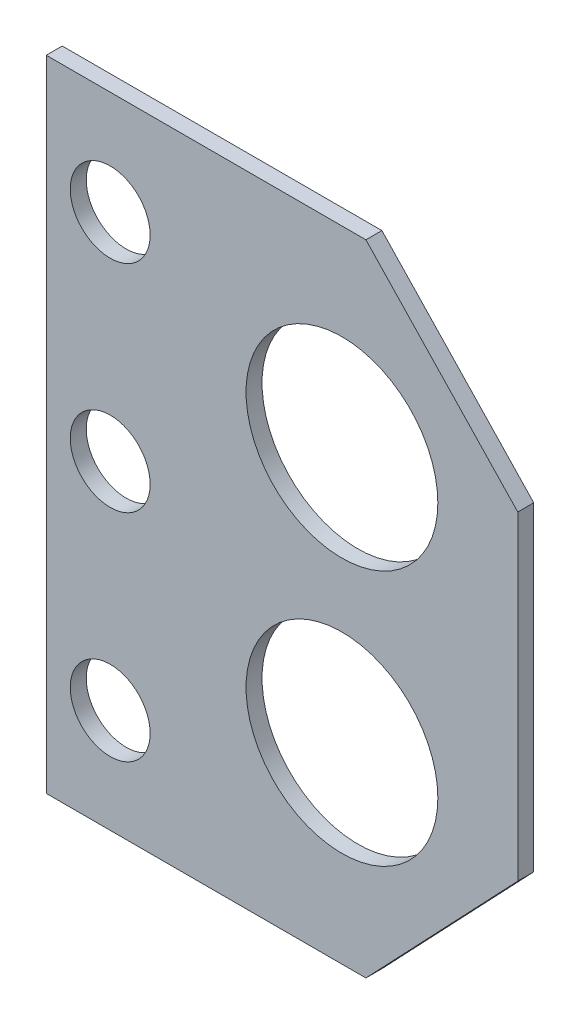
ISO-10303-21;
HEADER;
FILE_DESCRIPTION(('STEP AP214'),'2;1');
FILE_NAME('part.step','',(''),(''),'','','');
FILE_SCHEMA(('AUTOMOTIVE_DESIGN { 1 0 10303 214 1 1 1 1 }'));
ENDSEC;
DATA;
#1=APPLICATION_CONTEXT('core data for automotive mechanical design processes');
#2=APPLICATION_PROTOCOL_DEFINITION('international standard','automotive_design',2000,#1);
#3=PRODUCT_CONTEXT('',#1,'mechanical');
#4=PRODUCT('Part','Part','',(#3));
#5=PRODUCT_RELATED_PRODUCT_CATEGORY('part','',(#4));
#6=PRODUCT_DEFINITION_FORMATION('','',#4);
#7=PRODUCT_DEFINITION_CONTEXT('part definition',#1,'design');
#8=PRODUCT_DEFINITION('design','',#6,#7);
#9=PRODUCT_DEFINITION_SHAPE('','',#8);
#10=(LENGTH_UNIT() NAMED_UNIT(*) SI_UNIT(.MILLI.,.METRE.));
#11=(NAMED_UNIT(*) PLANE_ANGLE_UNIT() SI_UNIT($,.RADIAN.));
#12=(NAMED_UNIT(*) SI_UNIT($,.STERADIAN.) SOLID_ANGLE_UNIT());
#13=UNCERTAINTY_MEASURE_WITH_UNIT(LENGTH_MEASURE(1.E-05),#10,'distance_accuracy_value','');
#14=(GEOMETRIC_REPRESENTATION_CONTEXT(3) GLOBAL_UNCERTAINTY_ASSIGNED_CONTEXT((#13)) GLOBAL_UNIT_ASSIGNED_CONTEXT((#10,
#11,#12)) REPRESENTATION_CONTEXT('',''));
#15=CARTESIAN_POINT('',(0.,0.,0.));
#16=DIRECTION('',(0.,0.,1.));
#17=DIRECTION('',(1.,0.,0.));
#18=AXIS2_PLACEMENT_3D('',#15,#16,#17);
#19=CARTESIAN_POINT('',(200.,0.,10.));
#20=DIRECTION('',(0.,1.,0.));
#21=DIRECTION('',(0.,0.,1.));
#22=AXIS2_PLACEMENT_3D('',#19,#20,#21);
#23=PLANE('',#22);
#24=DIRECTION('',(1.,0.,0.));
#25=VECTOR('',#24,1.);
#26=CARTESIAN_POINT('',(200.,0.,0.));
#27=LINE('',#26,#25);
#28=CARTESIAN_POINT('',(0.,0.,0.));
#29=VERTEX_POINT('',#28);
#30=CARTESIAN_POINT('',(200.,0.,0.));
#31=VERTEX_POINT('',#30);
#32=EDGE_CURVE('E117',#29,#31,#27,.T.);
#33=ORIENTED_EDGE('',*,*,#32,.T.);
#34=DIRECTION('',(0.,0.,-1.));
#35=VECTOR('',#34,1.);
#36=CARTESIAN_POINT('',(200.,0.,10.));
#37=LINE('',#36,#35);
#38=CARTESIAN_POINT('',(200.,0.,10.));
#39=VERTEX_POINT('',#38);
#40=EDGE_CURVE('E11',#39,#31,#37,.T.);
#41=ORIENTED_EDGE('',*,*,#40,.F.);
#42=DIRECTION('',(1.,0.,0.));
#43=VECTOR('',#42,1.);
#44=CARTESIAN_POINT('',(200.,0.,10.));
#45=LINE('',#44,#43);
#46=CARTESIAN_POINT('',(0.,0.,10.));
#47=VERTEX_POINT('',#46);
#48=EDGE_CURVE('E128',#47,#39,#45,.T.);
#49=ORIENTED_EDGE('',*,*,#48,.F.);
#50=DIRECTION('',(0.,0.,-1.));
#51=VECTOR('',#50,1.);
#52=CARTESIAN_POINT('',(0.,0.,10.));
#53=LINE('',#52,#51);
#54=EDGE_CURVE('E113',#47,#29,#53,.T.);
#55=ORIENTED_EDGE('',*,*,#54,.T.);
#56=EDGE_LOOP('',(#33,#41,#49,#55));
#57=FACE_BOUND('',#56,.T.);
#58=ADVANCED_FACE('F33',(#57),#23,.F.);
#59=CARTESIAN_POINT('',(295.,100.,10.));
#60=DIRECTION('',(-0.724999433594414,0.688749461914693,0.));
#61=DIRECTION('',(-0.688749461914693,-0.724999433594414,0.));
#62=AXIS2_PLACEMENT_3D('',#59,#60,#61);
#63=PLANE('',#62);
#64=DIRECTION('',(0.688749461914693,0.724999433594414,0.));
#65=VECTOR('',#64,1.);
#66=CARTESIAN_POINT('',(295.,100.,0.));
#67=LINE('',#66,#65);
#68=CARTESIAN_POINT('',(295.,100.,0.));
#69=VERTEX_POINT('',#68);
#70=EDGE_CURVE('E120',#31,#69,#67,.T.);
#71=ORIENTED_EDGE('',*,*,#70,.T.);
#72=DIRECTION('',(0.,0.,-1.));
#73=VECTOR('',#72,1.);
#74=CARTESIAN_POINT('',(295.,100.,10.));
#75=LINE('',#74,#73);
#76=CARTESIAN_POINT('',(295.,100.,10.));
#77=VERTEX_POINT('',#76);
#78=EDGE_CURVE('E41',#77,#69,#75,.T.);
#79=ORIENTED_EDGE('',*,*,#78,.F.);
#80=DIRECTION('',(0.688749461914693,0.724999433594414,0.));
#81=VECTOR('',#80,1.);
#82=CARTESIAN_POINT('',(295.,100.,10.));
#83=LINE('',#82,#81);
#84=EDGE_CURVE('E86',#39,#77,#83,.T.);
#85=ORIENTED_EDGE('',*,*,#84,.F.);
#86=ORIENTED_EDGE('',*,*,#40,.T.);
#87=EDGE_LOOP('',(#71,#79,#85,#86));
#88=FACE_BOUND('',#87,.T.);
#89=ADVANCED_FACE('F153',(#88),#63,.F.);
#90=CARTESIAN_POINT('',(295.,300.,10.));
#91=DIRECTION('',(-1.,0.,0.));
#92=DIRECTION('',(0.,0.,1.));
#93=AXIS2_PLACEMENT_3D('',#90,#91,#92);
#94=PLANE('',#93);
#95=DIRECTION('',(0.,1.,0.));
#96=VECTOR('',#95,1.);
#97=CARTESIAN_POINT('',(295.,300.,0.));
#98=LINE('',#97,#96);
#99=CARTESIAN_POINT('',(295.,300.,0.));
#100=VERTEX_POINT('',#99);
#101=EDGE_CURVE('E123',#69,#100,#98,.T.);
#102=ORIENTED_EDGE('',*,*,#101,.T.);
#103=DIRECTION('',(0.,0.,-1.));
#104=VECTOR('',#103,1.);
#105=CARTESIAN_POINT('',(295.,300.,10.));
#106=LINE('',#105,#104);
#107=CARTESIAN_POINT('',(295.,300.,10.));
#108=VERTEX_POINT('',#107);
#109=EDGE_CURVE('E108',#108,#100,#106,.T.);
#110=ORIENTED_EDGE('',*,*,#109,.F.);
#111=DIRECTION('',(0.,1.,0.));
#112=VECTOR('',#111,1.);
#113=CARTESIAN_POINT('',(295.,300.,10.));
#114=LINE('',#113,#112);
#115=EDGE_CURVE('E99',#77,#108,#114,.T.);
#116=ORIENTED_EDGE('',*,*,#115,.F.);
#117=ORIENTED_EDGE('',*,*,#78,.T.);
#118=EDGE_LOOP('',(#102,#110,#116,#117));
#119=FACE_BOUND('',#118,.T.);
#120=ADVANCED_FACE('F134',(#119),#94,.F.);
#121=CARTESIAN_POINT('',(200.,400.,10.));
#122=DIRECTION('',(-0.724999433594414,-0.688749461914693,0.));
#123=DIRECTION('',(0.688749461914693,-0.724999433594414,0.));
#124=AXIS2_PLACEMENT_3D('',#121,#122,#123);
#125=PLANE('',#124);
#126=DIRECTION('',(-0.688749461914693,0.724999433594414,0.));
#127=VECTOR('',#126,1.);
#128=CARTESIAN_POINT('',(200.,400.,0.));
#129=LINE('',#128,#127);
#130=CARTESIAN_POINT('',(200.,400.,0.));
#131=VERTEX_POINT('',#130);
#132=EDGE_CURVE('E107',#100,#131,#129,.T.);
#133=ORIENTED_EDGE('',*,*,#132,.T.);
#134=DIRECTION('',(0.,0.,-1.));
#135=VECTOR('',#134,1.);
#136=CARTESIAN_POINT('',(200.,400.,10.));
#137=LINE('',#136,#135);
#138=CARTESIAN_POINT('',(200.,400.,10.));
#139=VERTEX_POINT('',#138);
#140=EDGE_CURVE('E104',#139,#131,#137,.T.);
#141=ORIENTED_EDGE('',*,*,#140,.F.);
#142=DIRECTION('',(-0.688749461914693,0.724999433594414,0.));
#143=VECTOR('',#142,1.);
#144=CARTESIAN_POINT('',(200.,400.,10.));
#145=LINE('',#144,#143);
#146=EDGE_CURVE('E93',#108,#139,#145,.T.);
#147=ORIENTED_EDGE('',*,*,#146,.F.);
#148=ORIENTED_EDGE('',*,*,#109,.T.);
#149=EDGE_LOOP('',(#133,#141,#147,#148));
#150=FACE_BOUND('',#149,.T.);
#151=ADVANCED_FACE('F105',(#150),#125,.F.);
#152=CARTESIAN_POINT('',(0.,400.,10.));
#153=DIRECTION('',(0.,-1.,0.));
#154=DIRECTION('',(0.,0.,-1.));
#155=AXIS2_PLACEMENT_3D('',#152,#153,#154);
#156=PLANE('',#155);
#157=DIRECTION('',(-1.,0.,0.));
#158=VECTOR('',#157,1.);
#159=CARTESIAN_POINT('',(0.,400.,0.));
#160=LINE('',#159,#158);
#161=CARTESIAN_POINT('',(0.,400.,0.));
#162=VERTEX_POINT('',#161);
#163=EDGE_CURVE('E72',#131,#162,#160,.T.);
#164=ORIENTED_EDGE('',*,*,#163,.T.);
#165=DIRECTION('',(0.,0.,-1.));
#166=VECTOR('',#165,1.);
#167=CARTESIAN_POINT('',(0.,400.,10.));
#168=LINE('',#167,#166);
#169=CARTESIAN_POINT('',(0.,400.,10.));
#170=VERTEX_POINT('',#169);
#171=EDGE_CURVE('E109',#170,#162,#168,.T.);
#172=ORIENTED_EDGE('',*,*,#171,.F.);
#173=DIRECTION('',(-1.,0.,0.));
#174=VECTOR('',#173,1.);
#175=CARTESIAN_POINT('',(0.,400.,10.));
#176=LINE('',#175,#174);
#177=EDGE_CURVE('E97',#139,#170,#176,.T.);
#178=ORIENTED_EDGE('',*,*,#177,.F.);
#179=ORIENTED_EDGE('',*,*,#140,.T.);
#180=EDGE_LOOP('',(#164,#172,#178,#179));
#181=FACE_BOUND('',#180,.T.);
#182=ADVANCED_FACE('F111',(#181),#156,.F.);
#183=CARTESIAN_POINT('',(0.,0.,10.));
#184=DIRECTION('',(1.,0.,0.));
#185=DIRECTION('',(0.,0.,-1.));
#186=AXIS2_PLACEMENT_3D('',#183,#184,#185);
#187=PLANE('',#186);
#188=DIRECTION('',(0.,-1.,0.));
#189=VECTOR('',#188,1.);
#190=CARTESIAN_POINT('',(0.,0.,0.));
#191=LINE('',#190,#189);
#192=EDGE_CURVE('E78',#162,#29,#191,.T.);
#193=ORIENTED_EDGE('',*,*,#192,.T.);
#194=ORIENTED_EDGE('',*,*,#54,.F.);
#195=DIRECTION('',(0.,-1.,0.));
#196=VECTOR('',#195,1.);
#197=CARTESIAN_POINT('',(0.,0.,10.));
#198=LINE('',#197,#196);
#199=EDGE_CURVE('E49',#170,#47,#198,.T.);
#200=ORIENTED_EDGE('',*,*,#199,.F.);
#201=ORIENTED_EDGE('',*,*,#171,.T.);
#202=EDGE_LOOP('',(#193,#194,#200,#201));
#203=FACE_BOUND('',#202,.T.);
#204=ADVANCED_FACE('F141',(#203),#187,.F.);
#205=CARTESIAN_POINT('',(0.,0.,10.));
#206=DIRECTION('',(0.,0.,-1.));
#207=DIRECTION('',(-1.,0.,0.));
#208=AXIS2_PLACEMENT_3D('',#205,#206,#207);
#209=PLANE('',#208);
#210=CARTESIAN_POINT('',(185.,120.,10.));
#211=DIRECTION('',(0.,0.,1.));
#212=DIRECTION('',(1.,0.,0.));
#213=AXIS2_PLACEMENT_3D('',#210,#211,#212);
#214=CIRCLE('',#213,60.);
#215=CARTESIAN_POINT('',(245.,120.,10.));
#216=VERTEX_POINT('',#215);
#217=EDGE_CURVE('E249',#216,#216,#214,.T.);
#218=ORIENTED_EDGE('',*,*,#217,.F.);
#219=EDGE_LOOP('',(#218));
#220=FACE_BOUND('',#219,.T.);
#221=CARTESIAN_POINT('',(185.,280.,10.));
#222=DIRECTION('',(0.,0.,1.));
#223=DIRECTION('',(1.,0.,0.));
#224=AXIS2_PLACEMENT_3D('',#221,#222,#223);
#225=CIRCLE('',#224,60.);
#226=CARTESIAN_POINT('',(245.,280.,10.));
#227=VERTEX_POINT('',#226);
#228=EDGE_CURVE('E251',#227,#227,#225,.T.);
#229=ORIENTED_EDGE('',*,*,#228,.F.);
#230=EDGE_LOOP('',(#229));
#231=FACE_BOUND('',#230,.T.);
#232=CARTESIAN_POINT('',(40.,65.,10.));
#233=DIRECTION('',(0.,0.,1.));
#234=DIRECTION('',(1.,0.,0.));
#235=AXIS2_PLACEMENT_3D('',#232,#233,#234);
#236=CIRCLE('',#235,25.);
#237=CARTESIAN_POINT('',(65.,65.,10.));
#238=VERTEX_POINT('',#237);
#239=EDGE_CURVE('E257',#238,#238,#236,.T.);
#240=ORIENTED_EDGE('',*,*,#239,.F.);
#241=EDGE_LOOP('',(#240));
#242=FACE_BOUND('',#241,.T.);
#243=CARTESIAN_POINT('',(40.,200.,10.));
#244=DIRECTION('',(0.,0.,1.));
#245=DIRECTION('',(1.,0.,0.));
#246=AXIS2_PLACEMENT_3D('',#243,#244,#245);
#247=CIRCLE('',#246,25.);
#248=CARTESIAN_POINT('',(65.,200.,10.));
#249=VERTEX_POINT('',#248);
#250=EDGE_CURVE('E263',#249,#249,#247,.T.);
#251=ORIENTED_EDGE('',*,*,#250,.F.);
#252=EDGE_LOOP('',(#251));
#253=FACE_BOUND('',#252,.T.);
#254=CARTESIAN_POINT('',(40.,335.,10.));
#255=DIRECTION('',(0.,0.,1.));
#256=DIRECTION('',(1.,0.,0.));
#257=AXIS2_PLACEMENT_3D('',#254,#255,#256);
#258=CIRCLE('',#257,25.);
#259=CARTESIAN_POINT('',(65.0000000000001,335.,10.));
#260=VERTEX_POINT('',#259);
#261=EDGE_CURVE('E269',#260,#260,#258,.T.);
#262=ORIENTED_EDGE('',*,*,#261,.F.);
#263=EDGE_LOOP('',(#262));
#264=FACE_BOUND('',#263,.T.);
#265=ORIENTED_EDGE('',*,*,#48,.T.);
#266=ORIENTED_EDGE('',*,*,#84,.T.);
#267=ORIENTED_EDGE('',*,*,#115,.T.);
#268=ORIENTED_EDGE('',*,*,#146,.T.);
#269=ORIENTED_EDGE('',*,*,#177,.T.);
#270=ORIENTED_EDGE('',*,*,#199,.T.);
#271=EDGE_LOOP('',(#265,#266,#267,#268,#269,#270));
#272=FACE_BOUND('',#271,.T.);
#273=ADVANCED_FACE('F95',(#220,#231,#242,#253,#264,#272),#209,.F.);
#274=CARTESIAN_POINT('',(0.,0.,0.));
#275=DIRECTION('',(0.,0.,-1.));
#276=DIRECTION('',(-1.,0.,0.));
#277=AXIS2_PLACEMENT_3D('',#274,#275,#276);
#278=PLANE('',#277);
#279=CARTESIAN_POINT('',(185.,120.,0.));
#280=DIRECTION('',(0.,0.,1.));
#281=DIRECTION('',(1.,0.,0.));
#282=AXIS2_PLACEMENT_3D('',#279,#280,#281);
#283=CIRCLE('',#282,60.);
#284=CARTESIAN_POINT('',(245.,120.,0.));
#285=VERTEX_POINT('',#284);
#286=EDGE_CURVE('E246',#285,#285,#283,.T.);
#287=ORIENTED_EDGE('',*,*,#286,.T.);
#288=EDGE_LOOP('',(#287));
#289=FACE_BOUND('',#288,.T.);
#290=CARTESIAN_POINT('',(185.,280.,0.));
#291=DIRECTION('',(0.,0.,1.));
#292=DIRECTION('',(1.,0.,0.));
#293=AXIS2_PLACEMENT_3D('',#290,#291,#292);
#294=CIRCLE('',#293,60.);
#295=CARTESIAN_POINT('',(245.,280.,0.));
#296=VERTEX_POINT('',#295);
#297=EDGE_CURVE('E254',#296,#296,#294,.T.);
#298=ORIENTED_EDGE('',*,*,#297,.T.);
#299=EDGE_LOOP('',(#298));
#300=FACE_BOUND('',#299,.T.);
#301=CARTESIAN_POINT('',(40.,65.,0.));
#302=DIRECTION('',(0.,0.,1.));
#303=DIRECTION('',(1.,0.,0.));
#304=AXIS2_PLACEMENT_3D('',#301,#302,#303);
#305=CIRCLE('',#304,25.);
#306=CARTESIAN_POINT('',(65.,65.,0.));
#307=VERTEX_POINT('',#306);
#308=EDGE_CURVE('E260',#307,#307,#305,.T.);
#309=ORIENTED_EDGE('',*,*,#308,.T.);
#310=EDGE_LOOP('',(#309));
#311=FACE_BOUND('',#310,.T.);
#312=CARTESIAN_POINT('',(40.,200.,0.));
#313=DIRECTION('',(0.,0.,1.));
#314=DIRECTION('',(1.,0.,0.));
#315=AXIS2_PLACEMENT_3D('',#312,#313,#314);
#316=CIRCLE('',#315,25.);
#317=CARTESIAN_POINT('',(65.,200.,0.));
#318=VERTEX_POINT('',#317);
#319=EDGE_CURVE('E266',#318,#318,#316,.T.);
#320=ORIENTED_EDGE('',*,*,#319,.T.);
#321=EDGE_LOOP('',(#320));
#322=FACE_BOUND('',#321,.T.);
#323=CARTESIAN_POINT('',(40.,335.,0.));
#324=DIRECTION('',(0.,0.,1.));
#325=DIRECTION('',(1.,0.,0.));
#326=AXIS2_PLACEMENT_3D('',#323,#324,#325);
#327=CIRCLE('',#326,25.);
#328=CARTESIAN_POINT('',(65.0000000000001,335.,0.));
#329=VERTEX_POINT('',#328);
#330=EDGE_CURVE('E121',#329,#329,#327,.T.);
#331=ORIENTED_EDGE('',*,*,#330,.T.);
#332=EDGE_LOOP('',(#331));
#333=FACE_BOUND('',#332,.T.);
#334=ORIENTED_EDGE('',*,*,#32,.F.);
#335=ORIENTED_EDGE('',*,*,#192,.F.);
#336=ORIENTED_EDGE('',*,*,#163,.F.);
#337=ORIENTED_EDGE('',*,*,#132,.F.);
#338=ORIENTED_EDGE('',*,*,#101,.F.);
#339=ORIENTED_EDGE('',*,*,#70,.F.);
#340=EDGE_LOOP('',(#334,#335,#336,#337,#338,#339));
#341=FACE_BOUND('',#340,.T.);
#342=ADVANCED_FACE('F137',(#289,#300,#311,#322,#333,#341),#278,.T.);
#343=CARTESIAN_POINT('',(40.,335.,0.));
#344=DIRECTION('',(0.,0.,1.));
#345=DIRECTION('',(1.,0.,0.));
#346=AXIS2_PLACEMENT_3D('',#343,#344,#345);
#347=CYLINDRICAL_SURFACE('',#346,25.);
#348=ORIENTED_EDGE('',*,*,#330,.F.);
#349=EDGE_LOOP('',(#348));
#350=FACE_BOUND('',#349,.T.);
#351=ORIENTED_EDGE('',*,*,#261,.T.);
#352=EDGE_LOOP('',(#351));
#353=FACE_BOUND('',#352,.T.);
#354=ADVANCED_FACE('F190',(#350,#353),#347,.F.);
#355=CARTESIAN_POINT('',(40.,200.,0.));
#356=DIRECTION('',(0.,0.,1.));
#357=DIRECTION('',(1.,0.,0.));
#358=AXIS2_PLACEMENT_3D('',#355,#356,#357);
#359=CYLINDRICAL_SURFACE('',#358,25.);
#360=ORIENTED_EDGE('',*,*,#319,.F.);
#361=EDGE_LOOP('',(#360));
#362=FACE_BOUND('',#361,.T.);
#363=ORIENTED_EDGE('',*,*,#250,.T.);
#364=EDGE_LOOP('',(#363));
#365=FACE_BOUND('',#364,.T.);
#366=ADVANCED_FACE('F199',(#362,#365),#359,.F.);
#367=CARTESIAN_POINT('',(40.,65.,0.));
#368=DIRECTION('',(0.,0.,1.));
#369=DIRECTION('',(1.,0.,0.));
#370=AXIS2_PLACEMENT_3D('',#367,#368,#369);
#371=CYLINDRICAL_SURFACE('',#370,25.);
#372=ORIENTED_EDGE('',*,*,#308,.F.);
#373=EDGE_LOOP('',(#372));
#374=FACE_BOUND('',#373,.T.);
#375=ORIENTED_EDGE('',*,*,#239,.T.);
#376=EDGE_LOOP('',(#375));
#377=FACE_BOUND('',#376,.T.);
#378=ADVANCED_FACE('F209',(#374,#377),#371,.F.);
#379=CARTESIAN_POINT('',(185.,280.,0.));
#380=DIRECTION('',(0.,0.,1.));
#381=DIRECTION('',(1.,0.,0.));
#382=AXIS2_PLACEMENT_3D('',#379,#380,#381);
#383=CYLINDRICAL_SURFACE('',#382,60.);
#384=ORIENTED_EDGE('',*,*,#297,.F.);
#385=EDGE_LOOP('',(#384));
#386=FACE_BOUND('',#385,.T.);
#387=ORIENTED_EDGE('',*,*,#228,.T.);
#388=EDGE_LOOP('',(#387));
#389=FACE_BOUND('',#388,.T.);
#390=ADVANCED_FACE('F219',(#386,#389),#383,.F.);
#391=CARTESIAN_POINT('',(185.,120.,0.));
#392=DIRECTION('',(0.,0.,1.));
#393=DIRECTION('',(1.,0.,0.));
#394=AXIS2_PLACEMENT_3D('',#391,#392,#393);
#395=CYLINDRICAL_SURFACE('',#394,60.);
#396=ORIENTED_EDGE('',*,*,#286,.F.);
#397=EDGE_LOOP('',(#396));
#398=FACE_BOUND('',#397,.T.);
#399=ORIENTED_EDGE('',*,*,#217,.T.);
#400=EDGE_LOOP('',(#399));
#401=FACE_BOUND('',#400,.T.);
#402=ADVANCED_FACE('F229',(#398,#401),#395,.F.);
#403=CLOSED_SHELL('',(#58,#89,#120,#151,#182,#204,#273,#342,#354,#366,#378,#390,#402));
#404=MANIFOLD_SOLID_BREP('B2',#403);
#405=ADVANCED_BREP_SHAPE_REPRESENTATION('',(#18,#404),#14);
#406=SHAPE_DEFINITION_REPRESENTATION(#9,#405);
ENDSEC;
END-ISO-10303-21;
